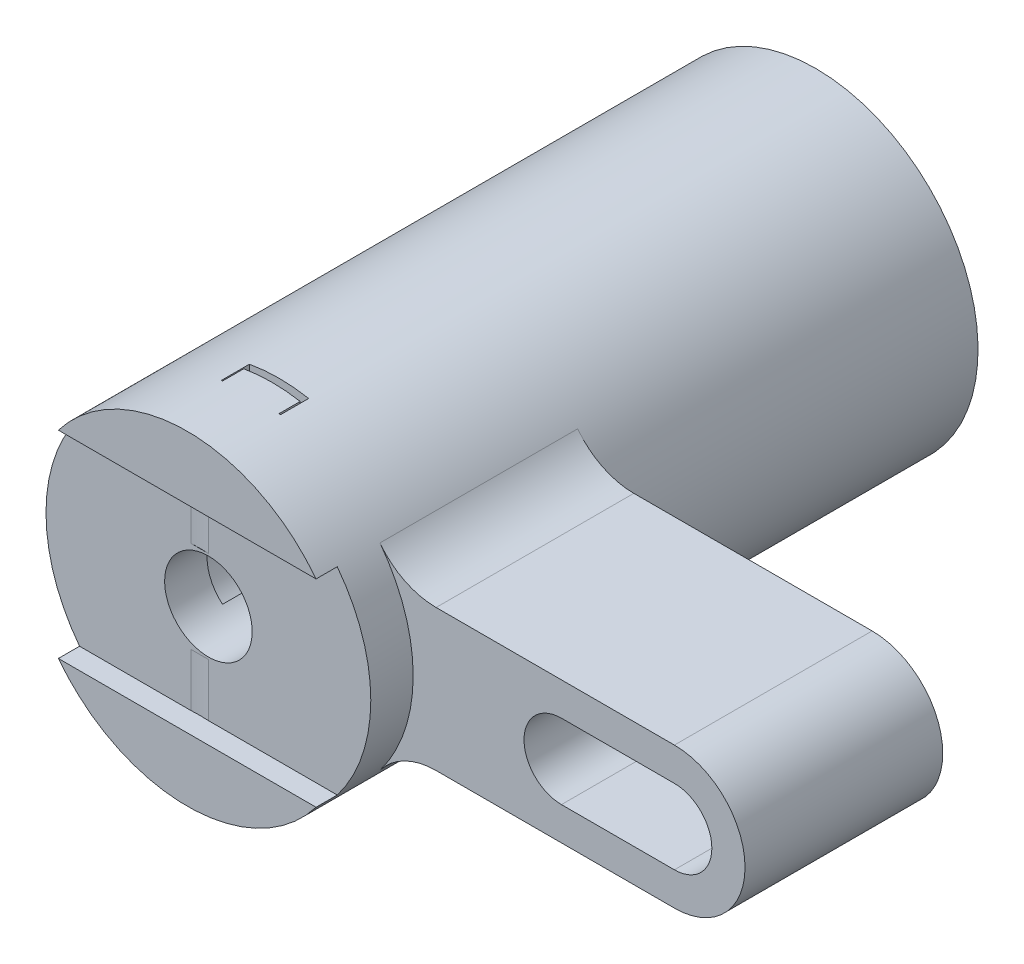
ISO-10303-21;
HEADER;
FILE_DESCRIPTION(('STEP AP214'),'2;1');
FILE_NAME('part.step','',(''),(''),'','','');
FILE_SCHEMA(('AUTOMOTIVE_DESIGN { 1 0 10303 214 1 1 1 1 }'));
ENDSEC;
DATA;
#1=APPLICATION_CONTEXT('core data for automotive mechanical design processes');
#2=APPLICATION_PROTOCOL_DEFINITION('international standard','automotive_design',2000,#1);
#3=PRODUCT_CONTEXT('',#1,'mechanical');
#4=PRODUCT('Part','Part','',(#3));
#5=PRODUCT_RELATED_PRODUCT_CATEGORY('part','',(#4));
#6=PRODUCT_DEFINITION_FORMATION('','',#4);
#7=PRODUCT_DEFINITION_CONTEXT('part definition',#1,'design');
#8=PRODUCT_DEFINITION('design','',#6,#7);
#9=PRODUCT_DEFINITION_SHAPE('','',#8);
#10=(LENGTH_UNIT() NAMED_UNIT(*) SI_UNIT(.MILLI.,.METRE.));
#11=(NAMED_UNIT(*) PLANE_ANGLE_UNIT() SI_UNIT($,.RADIAN.));
#12=(NAMED_UNIT(*) SI_UNIT($,.STERADIAN.) SOLID_ANGLE_UNIT());
#13=UNCERTAINTY_MEASURE_WITH_UNIT(LENGTH_MEASURE(1.E-05),#10,'distance_accuracy_value','');
#14=(GEOMETRIC_REPRESENTATION_CONTEXT(3) GLOBAL_UNCERTAINTY_ASSIGNED_CONTEXT((#13)) GLOBAL_UNIT_ASSIGNED_CONTEXT((#10,
#11,#12)) REPRESENTATION_CONTEXT('',''));
#15=CARTESIAN_POINT('',(0.,0.,0.));
#16=DIRECTION('',(0.,0.,1.));
#17=DIRECTION('',(1.,0.,0.));
#18=AXIS2_PLACEMENT_3D('',#15,#16,#17);
#19=CARTESIAN_POINT('',(-10.0000000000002,-3.25,103.977));
#20=DIRECTION('',(0.,-1.,0.));
#21=DIRECTION('',(-1.,0.,0.));
#22=AXIS2_PLACEMENT_3D('',#19,#20,#21);
#23=PLANE('',#22);
#24=CARTESIAN_POINT('',(0.,-3.25,62.977));
#25=CARTESIAN_POINT('',(1.17809724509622,-3.25,63.059375));
#26=CARTESIAN_POINT('',(2.38889185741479,-3.25,62.9073425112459));
#27=CARTESIAN_POINT('',(4.68855121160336,-3.25,62.133116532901));
#28=CARTESIAN_POINT('',(5.77641227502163,-3.25,61.5109889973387));
#29=CARTESIAN_POINT('',(7.65048483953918,-3.25,59.869908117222));
#30=CARTESIAN_POINT('',(8.43577630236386,-3.25,58.8514177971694));
#31=CARTESIAN_POINT('',(9.56393765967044,-3.25,56.5583078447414));
#32=CARTESIAN_POINT('',(9.906125,-3.25,55.2844915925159));
#33=CARTESIAN_POINT('',(10.070875,-3.25,52.669508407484));
#34=CARTESIAN_POINT('',(9.89311450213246,-3.25,51.329370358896));
#35=CARTESIAN_POINT('',(9.01985437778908,-3.25,48.7906214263));
#36=CARTESIAN_POINT('',(8.32445967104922,-3.25,47.5931082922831));
#37=CARTESIAN_POINT('',(6.50038754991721,-3.25,45.5360444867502));
#38=CARTESIAN_POINT('',(5.37224515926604,-3.25,44.6774858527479));
#39=CARTESIAN_POINT('',(2.84004562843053,-3.25,43.4502903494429));
#40=CARTESIAN_POINT('',(1.43688593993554,-3.25,43.082375));
#41=CARTESIAN_POINT('',(-1.43688593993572,-3.25,42.917625));
#42=CARTESIAN_POINT('',(-2.90636742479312,-3.25,43.1211135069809));
#43=CARTESIAN_POINT('',(-5.68420593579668,-3.25,44.0934077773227));
#44=CARTESIAN_POINT('',(-6.99137114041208,-3.25,44.8620696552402));
#45=CARTESIAN_POINT('',(-9.23142618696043,-3.25,46.8691330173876));
#46=CARTESIAN_POINT('',(-10.1632519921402,-3.25,48.1069274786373));
#47=CARTESIAN_POINT('',(-11.4894816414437,-3.25,50.8782165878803));
#48=CARTESIAN_POINT('',(-11.883125,-3.25,52.4107197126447));
#49=CARTESIAN_POINT('',(-12.047875,-3.25,55.5432802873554));
#50=CARTESIAN_POINT('',(-11.8186584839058,-3.25,57.1421052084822));
#51=CARTESIAN_POINT('',(-10.7473300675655,-3.25,60.1590332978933));
#52=CARTESIAN_POINT('',(-9.90540101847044,-3.25,61.5758505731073));
#53=CARTESIAN_POINT('',(-7.71534641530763,-3.25,63.998896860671));
#54=CARTESIAN_POINT('',(-6.36789988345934,-3.25,65.0039898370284));
#55=CARTESIAN_POINT('',(-3.35752119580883,-3.25,66.4292536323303));
#56=CARTESIAN_POINT('',(-1.69567463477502,-3.25,66.848625));
#57=CARTESIAN_POINT('',(0.,-3.25,66.931));
#58=B_SPLINE_CURVE_WITH_KNOTS('',3,(#24,#25,#26,#27,#28,#29,#30,#31,#32,#33,#34,#35,#36,#37,#38,
#39,#40,#41,#42,#43,#44,#45,#46,#47,#48,#49,#50,#51,#52,#53,#54,#55,#56,#57),.UNSPECIFIED.,.F.,
.F.,(4,2,2,2,2,2,2,2,2,2,2,2,2,2,2,2,4),(0.,0.0625,0.125,0.1875,0.25,0.3125,0.375,0.4375,0.5,
0.5625,0.625,0.6875,0.75,0.8125,0.875,0.9375,1.),.UNSPECIFIED.);
#59=CARTESIAN_POINT('',(-1.24892937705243,-3.25,43.));
#60=VERTEX_POINT('',#59);
#61=CARTESIAN_POINT('',(0.,-3.25,43.));
#62=VERTEX_POINT('',#61);
#63=EDGE_CURVE('E409',#60,#62,#58,.F.);
#64=ORIENTED_EDGE('',*,*,#63,.T.);
#65=DIRECTION('',(1.,0.,0.));
#66=VECTOR('',#65,1.);
#67=CARTESIAN_POINT('',(0.,-3.25,43.));
#68=LINE('',#67,#66);
#69=EDGE_CURVE('E587',#60,#62,#68,.T.);
#70=ORIENTED_EDGE('',*,*,#69,.F.);
#71=EDGE_LOOP('',(#64,#70));
#72=FACE_BOUND('',#71,.T.);
#73=ADVANCED_FACE('F14',(#72),#23,.T.);
#74=CARTESIAN_POINT('',(0.,9.5,62.977));
#75=CARTESIAN_POINT('',(1.17809724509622,9.5,63.059375));
#76=CARTESIAN_POINT('',(2.38889185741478,9.5,62.9073425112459));
#77=CARTESIAN_POINT('',(4.68855121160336,9.5,62.133116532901));
#78=CARTESIAN_POINT('',(5.77641227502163,9.5,61.5109889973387));
#79=CARTESIAN_POINT('',(7.65048483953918,9.5,59.869908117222));
#80=CARTESIAN_POINT('',(8.43577630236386,9.5,58.8514177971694));
#81=CARTESIAN_POINT('',(9.56393765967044,9.5,56.5583078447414));
#82=CARTESIAN_POINT('',(9.906125,9.5,55.284491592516));
#83=CARTESIAN_POINT('',(10.070875,9.5,52.669508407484));
#84=CARTESIAN_POINT('',(9.89311450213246,9.5,51.3293703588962));
#85=CARTESIAN_POINT('',(9.01985437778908,9.5,48.7906214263));
#86=CARTESIAN_POINT('',(8.32445967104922,9.5,47.5931082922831));
#87=CARTESIAN_POINT('',(6.50038754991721,9.5,45.5360444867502));
#88=CARTESIAN_POINT('',(5.37224515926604,9.5,44.6774858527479));
#89=CARTESIAN_POINT('',(2.84004562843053,9.5,43.4502903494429));
#90=CARTESIAN_POINT('',(1.43688593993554,9.5,43.082375));
#91=CARTESIAN_POINT('',(-1.43688593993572,9.5,42.917625));
#92=CARTESIAN_POINT('',(-2.90636742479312,9.5,43.1211135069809));
#93=CARTESIAN_POINT('',(-5.68420593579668,9.5,44.0934077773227));
#94=CARTESIAN_POINT('',(-6.99137114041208,9.5,44.8620696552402));
#95=CARTESIAN_POINT('',(-9.23142618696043,9.5,46.8691330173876));
#96=CARTESIAN_POINT('',(-10.1632519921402,9.5,48.1069274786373));
#97=CARTESIAN_POINT('',(-11.4894816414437,9.5,50.8782165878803));
#98=CARTESIAN_POINT('',(-11.883125,9.5,52.4107197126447));
#99=CARTESIAN_POINT('',(-12.047875,9.5,55.5432802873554));
#100=CARTESIAN_POINT('',(-11.8186584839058,9.5,57.1421052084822));
#101=CARTESIAN_POINT('',(-10.7473300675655,9.5,60.1590332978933));
#102=CARTESIAN_POINT('',(-9.90540101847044,9.5,61.5758505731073));
#103=CARTESIAN_POINT('',(-7.71534641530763,9.5,63.998896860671));
#104=CARTESIAN_POINT('',(-6.36789988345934,9.5,65.0039898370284));
#105=CARTESIAN_POINT('',(-3.35752119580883,9.5,66.4292536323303));
#106=CARTESIAN_POINT('',(-1.69567463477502,9.5,66.848625));
#107=CARTESIAN_POINT('',(0.,9.5,66.931));
#108=B_SPLINE_CURVE_WITH_KNOTS('',3,(#74,#75,#76,#77,#78,#79,#80,#81,#82,#83,#84,#85,#86,#87,
#88,#89,#90,#91,#92,#93,#94,#95,#96,#97,#98,#99,#100,#101,#102,#103,#104,#105,#106,#107),
.UNSPECIFIED.,.F.,.F.,(4,2,2,2,2,2,2,2,2,2,2,2,2,2,2,2,4),(0.,0.0625,0.125,0.1875,0.25,0.3125,
0.375,0.4375,0.5,0.5625,0.625,0.6875,0.75,0.8125,0.875,0.9375,1.),.UNSPECIFIED.);
#109=DIRECTION('',(0.,-1.,0.));
#110=VECTOR('',#109,1.);
#111=SURFACE_OF_LINEAR_EXTRUSION('',#108,#110);
#112=ORIENTED_EDGE('',*,*,#63,.F.);
#113=DIRECTION('',(0.,-1.,0.));
#114=VECTOR('',#113,1.);
#115=CARTESIAN_POINT('',(-1.24892937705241,-5.125,43.));
#116=LINE('',#115,#114);
#117=CARTESIAN_POINT('',(-1.24892937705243,-7.,43.));
#118=VERTEX_POINT('',#117);
#119=EDGE_CURVE('E434',#118,#60,#116,.F.);
#120=ORIENTED_EDGE('',*,*,#119,.F.);
#121=CARTESIAN_POINT('',(0.,-7.,62.977));
#122=CARTESIAN_POINT('',(1.17809724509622,-7.,63.059375));
#123=CARTESIAN_POINT('',(2.38889185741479,-7.,62.9073425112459));
#124=CARTESIAN_POINT('',(4.68855121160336,-7.,62.133116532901));
#125=CARTESIAN_POINT('',(5.77641227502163,-7.,61.5109889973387));
#126=CARTESIAN_POINT('',(7.65048483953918,-7.,59.869908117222));
#127=CARTESIAN_POINT('',(8.43577630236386,-7.,58.8514177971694));
#128=CARTESIAN_POINT('',(9.56393765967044,-7.,56.5583078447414));
#129=CARTESIAN_POINT('',(9.906125,-7.,55.2844915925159));
#130=CARTESIAN_POINT('',(10.070875,-7.,52.669508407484));
#131=CARTESIAN_POINT('',(9.89311450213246,-7.,51.329370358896));
#132=CARTESIAN_POINT('',(9.01985437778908,-7.,48.7906214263));
#133=CARTESIAN_POINT('',(8.32445967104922,-7.,47.5931082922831));
#134=CARTESIAN_POINT('',(6.50038754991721,-7.,45.5360444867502));
#135=CARTESIAN_POINT('',(5.37224515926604,-7.,44.6774858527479));
#136=CARTESIAN_POINT('',(2.84004562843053,-7.,43.4502903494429));
#137=CARTESIAN_POINT('',(1.43688593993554,-7.,43.082375));
#138=CARTESIAN_POINT('',(-1.43688593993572,-7.,42.917625));
#139=CARTESIAN_POINT('',(-2.90636742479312,-7.,43.1211135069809));
#140=CARTESIAN_POINT('',(-5.68420593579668,-7.,44.0934077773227));
#141=CARTESIAN_POINT('',(-6.99137114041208,-7.,44.8620696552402));
#142=CARTESIAN_POINT('',(-9.23142618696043,-7.,46.8691330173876));
#143=CARTESIAN_POINT('',(-10.1632519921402,-7.,48.1069274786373));
#144=CARTESIAN_POINT('',(-11.4894816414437,-7.,50.8782165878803));
#145=CARTESIAN_POINT('',(-11.883125,-7.,52.4107197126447));
#146=CARTESIAN_POINT('',(-12.047875,-7.,55.5432802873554));
#147=CARTESIAN_POINT('',(-11.8186584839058,-7.,57.1421052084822));
#148=CARTESIAN_POINT('',(-10.7473300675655,-7.,60.1590332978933));
#149=CARTESIAN_POINT('',(-9.90540101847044,-7.,61.5758505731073));
#150=CARTESIAN_POINT('',(-7.71534641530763,-7.,63.998896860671));
#151=CARTESIAN_POINT('',(-6.36789988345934,-7.,65.0039898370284));
#152=CARTESIAN_POINT('',(-3.35752119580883,-7.,66.4292536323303));
#153=CARTESIAN_POINT('',(-1.69567463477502,-7.,66.848625));
#154=CARTESIAN_POINT('',(0.,-7.,66.931));
#155=B_SPLINE_CURVE_WITH_KNOTS('',3,(#121,#122,#123,#124,#125,#126,#127,#128,#129,#130,#131,
#132,#133,#134,#135,#136,#137,#138,#139,#140,#141,#142,#143,#144,#145,#146,#147,#148,#149,#150,
#151,#152,#153,#154),.UNSPECIFIED.,.F.,.F.,(4,2,2,2,2,2,2,2,2,2,2,2,2,2,2,2,4),(0.,0.0625,0.125,
0.1875,0.25,0.3125,0.375,0.4375,0.5,0.5625,0.625,0.6875,0.75,0.8125,0.875,0.9375,1.),.UNSPECIFIED.);
#156=CARTESIAN_POINT('',(0.,-7.,43.));
#157=VERTEX_POINT('',#156);
#158=EDGE_CURVE('E127',#118,#157,#155,.F.);
#159=ORIENTED_EDGE('',*,*,#158,.T.);
#160=DIRECTION('',(0.,-1.,0.));
#161=VECTOR('',#160,1.);
#162=CARTESIAN_POINT('',(-1.59984872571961E-12,-5.125,43.));
#163=LINE('',#162,#161);
#164=EDGE_CURVE('E592',#62,#157,#163,.T.);
#165=ORIENTED_EDGE('',*,*,#164,.F.);
#166=EDGE_LOOP('',(#112,#120,#159,#165));
#167=FACE_BOUND('',#166,.T.);
#168=ADVANCED_FACE('F447',(#167),#111,.T.);
#169=CARTESIAN_POINT('',(-10.0000000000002,3.25,103.977));
#170=DIRECTION('',(0.,1.,0.));
#171=DIRECTION('',(1.,0.,0.));
#172=AXIS2_PLACEMENT_3D('',#169,#170,#171);
#173=PLANE('',#172);
#174=CARTESIAN_POINT('',(0.,3.25,62.977));
#175=CARTESIAN_POINT('',(1.17809724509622,3.25,63.059375));
#176=CARTESIAN_POINT('',(2.38889185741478,3.25,62.9073425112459));
#177=CARTESIAN_POINT('',(4.68855121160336,3.25,62.133116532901));
#178=CARTESIAN_POINT('',(5.77641227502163,3.25,61.5109889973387));
#179=CARTESIAN_POINT('',(7.65048483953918,3.25,59.869908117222));
#180=CARTESIAN_POINT('',(8.43577630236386,3.25,58.8514177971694));
#181=CARTESIAN_POINT('',(9.56393765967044,3.25,56.5583078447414));
#182=CARTESIAN_POINT('',(9.906125,3.25,55.284491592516));
#183=CARTESIAN_POINT('',(10.070875,3.25,52.669508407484));
#184=CARTESIAN_POINT('',(9.89311450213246,3.25,51.329370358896));
#185=CARTESIAN_POINT('',(9.01985437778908,3.25,48.7906214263));
#186=CARTESIAN_POINT('',(8.32445967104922,3.25,47.5931082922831));
#187=CARTESIAN_POINT('',(6.50038754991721,3.25,45.5360444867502));
#188=CARTESIAN_POINT('',(5.37224515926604,3.25,44.6774858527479));
#189=CARTESIAN_POINT('',(2.84004562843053,3.25,43.4502903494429));
#190=CARTESIAN_POINT('',(1.43688593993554,3.25,43.082375));
#191=CARTESIAN_POINT('',(-1.43688593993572,3.25,42.917625));
#192=CARTESIAN_POINT('',(-2.90636742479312,3.25,43.1211135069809));
#193=CARTESIAN_POINT('',(-5.68420593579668,3.25,44.0934077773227));
#194=CARTESIAN_POINT('',(-6.99137114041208,3.25,44.8620696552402));
#195=CARTESIAN_POINT('',(-9.23142618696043,3.25,46.8691330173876));
#196=CARTESIAN_POINT('',(-10.1632519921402,3.25,48.1069274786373));
#197=CARTESIAN_POINT('',(-11.4894816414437,3.25,50.8782165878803));
#198=CARTESIAN_POINT('',(-11.883125,3.25,52.4107197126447));
#199=CARTESIAN_POINT('',(-12.047875,3.25,55.5432802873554));
#200=CARTESIAN_POINT('',(-11.8186584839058,3.25,57.1421052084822));
#201=CARTESIAN_POINT('',(-10.7473300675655,3.25,60.1590332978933));
#202=CARTESIAN_POINT('',(-9.90540101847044,3.25,61.5758505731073));
#203=CARTESIAN_POINT('',(-7.71534641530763,3.25,63.998896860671));
#204=CARTESIAN_POINT('',(-6.36789988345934,3.25,65.0039898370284));
#205=CARTESIAN_POINT('',(-3.35752119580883,3.25,66.4292536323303));
#206=CARTESIAN_POINT('',(-1.69567463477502,3.25,66.848625));
#207=CARTESIAN_POINT('',(0.,3.25,66.931));
#208=B_SPLINE_CURVE_WITH_KNOTS('',3,(#174,#175,#176,#177,#178,#179,#180,#181,#182,#183,#184,
#185,#186,#187,#188,#189,#190,#191,#192,#193,#194,#195,#196,#197,#198,#199,#200,#201,#202,#203,
#204,#205,#206,#207),.UNSPECIFIED.,.F.,.F.,(4,2,2,2,2,2,2,2,2,2,2,2,2,2,2,2,4),(0.,0.0625,0.125,
0.1875,0.25,0.3125,0.375,0.4375,0.5,0.5625,0.625,0.6875,0.75,0.8125,0.875,0.9375,1.),.UNSPECIFIED.);
#209=CARTESIAN_POINT('',(0.,3.25,43.));
#210=VERTEX_POINT('',#209);
#211=CARTESIAN_POINT('',(-1.24892937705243,3.25,43.));
#212=VERTEX_POINT('',#211);
#213=EDGE_CURVE('E426',#210,#212,#208,.T.);
#214=ORIENTED_EDGE('',*,*,#213,.T.);
#215=DIRECTION('',(-1.,0.,0.));
#216=VECTOR('',#215,1.);
#217=CARTESIAN_POINT('',(0.,3.25,43.));
#218=LINE('',#217,#216);
#219=EDGE_CURVE('E297',#210,#212,#218,.T.);
#220=ORIENTED_EDGE('',*,*,#219,.F.);
#221=EDGE_LOOP('',(#214,#220));
#222=FACE_BOUND('',#221,.T.);
#223=ADVANCED_FACE('F451',(#222),#173,.T.);
#224=CARTESIAN_POINT('',(0.,7.,62.977));
#225=CARTESIAN_POINT('',(1.17809724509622,7.,63.059375));
#226=CARTESIAN_POINT('',(2.38889185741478,7.,62.9073425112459));
#227=CARTESIAN_POINT('',(4.68855121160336,7.,62.133116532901));
#228=CARTESIAN_POINT('',(5.77641227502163,7.,61.5109889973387));
#229=CARTESIAN_POINT('',(7.65048483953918,7.,59.869908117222));
#230=CARTESIAN_POINT('',(8.43577630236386,7.,58.8514177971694));
#231=CARTESIAN_POINT('',(9.56393765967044,7.,56.5583078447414));
#232=CARTESIAN_POINT('',(9.906125,7.,55.284491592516));
#233=CARTESIAN_POINT('',(10.070875,7.,52.669508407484));
#234=CARTESIAN_POINT('',(9.89311450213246,7.,51.3293703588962));
#235=CARTESIAN_POINT('',(9.01985437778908,7.,48.7906214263));
#236=CARTESIAN_POINT('',(8.32445967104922,7.,47.5931082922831));
#237=CARTESIAN_POINT('',(6.50038754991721,7.,45.5360444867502));
#238=CARTESIAN_POINT('',(5.37224515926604,7.,44.6774858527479));
#239=CARTESIAN_POINT('',(2.84004562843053,7.,43.4502903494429));
#240=CARTESIAN_POINT('',(1.43688593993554,7.,43.082375));
#241=CARTESIAN_POINT('',(-1.43688593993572,7.,42.917625));
#242=CARTESIAN_POINT('',(-2.90636742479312,7.,43.1211135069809));
#243=CARTESIAN_POINT('',(-5.68420593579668,7.,44.0934077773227));
#244=CARTESIAN_POINT('',(-6.99137114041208,7.,44.8620696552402));
#245=CARTESIAN_POINT('',(-9.23142618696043,7.,46.8691330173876));
#246=CARTESIAN_POINT('',(-10.1632519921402,7.,48.1069274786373));
#247=CARTESIAN_POINT('',(-11.4894816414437,7.,50.8782165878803));
#248=CARTESIAN_POINT('',(-11.883125,7.,52.4107197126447));
#249=CARTESIAN_POINT('',(-12.047875,7.,55.5432802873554));
#250=CARTESIAN_POINT('',(-11.8186584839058,7.,57.1421052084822));
#251=CARTESIAN_POINT('',(-10.7473300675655,7.,60.1590332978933));
#252=CARTESIAN_POINT('',(-9.90540101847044,7.,61.5758505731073));
#253=CARTESIAN_POINT('',(-7.71534641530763,7.,63.998896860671));
#254=CARTESIAN_POINT('',(-6.36789988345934,7.,65.0039898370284));
#255=CARTESIAN_POINT('',(-3.35752119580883,7.,66.4292536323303));
#256=CARTESIAN_POINT('',(-1.69567463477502,7.,66.848625));
#257=CARTESIAN_POINT('',(0.,7.,66.931));
#258=B_SPLINE_CURVE_WITH_KNOTS('',3,(#224,#225,#226,#227,#228,#229,#230,#231,#232,#233,#234,
#235,#236,#237,#238,#239,#240,#241,#242,#243,#244,#245,#246,#247,#248,#249,#250,#251,#252,#253,
#254,#255,#256,#257),.UNSPECIFIED.,.F.,.F.,(4,2,2,2,2,2,2,2,2,2,2,2,2,2,2,2,4),(0.,0.0625,0.125,
0.1875,0.25,0.3125,0.375,0.4375,0.5,0.5625,0.625,0.6875,0.75,0.8125,0.875,0.9375,1.),.UNSPECIFIED.);
#259=CARTESIAN_POINT('',(-1.24892937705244,7.,43.));
#260=VERTEX_POINT('',#259);
#261=CARTESIAN_POINT('',(0.,7.,43.));
#262=VERTEX_POINT('',#261);
#263=EDGE_CURVE('E407',#260,#262,#258,.F.);
#264=ORIENTED_EDGE('',*,*,#263,.F.);
#265=DIRECTION('',(0.,-1.,0.));
#266=VECTOR('',#265,1.);
#267=CARTESIAN_POINT('',(-1.24892937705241,5.125,43.));
#268=LINE('',#267,#266);
#269=EDGE_CURVE('E712',#212,#260,#268,.F.);
#270=ORIENTED_EDGE('',*,*,#269,.F.);
#271=ORIENTED_EDGE('',*,*,#213,.F.);
#272=DIRECTION('',(0.,-1.,0.));
#273=VECTOR('',#272,1.);
#274=CARTESIAN_POINT('',(-1.61025706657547E-12,5.125,43.));
#275=LINE('',#274,#273);
#276=EDGE_CURVE('E709',#262,#210,#275,.T.);
#277=ORIENTED_EDGE('',*,*,#276,.F.);
#278=EDGE_LOOP('',(#264,#270,#271,#277));
#279=FACE_BOUND('',#278,.T.);
#280=ADVANCED_FACE('F452',(#279),#111,.T.);
#281=CARTESIAN_POINT('',(-2.,11.3247516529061,38.5));
#282=DIRECTION('',(1.,0.,0.));
#283=DIRECTION('',(0.,1.,0.));
#284=AXIS2_PLACEMENT_3D('',#281,#282,#283);
#285=PLANE('',#284);
#286=DIRECTION('',(0.,1.,0.));
#287=VECTOR('',#286,1.);
#288=CARTESIAN_POINT('',(-2.,11.3247516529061,38.5));
#289=LINE('',#288,#287);
#290=CARTESIAN_POINT('',(-2.,2.36854385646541,38.5));
#291=VERTEX_POINT('',#290);
#292=CARTESIAN_POINT('',(-2.,11.3247516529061,38.5));
#293=VERTEX_POINT('',#292);
#294=EDGE_CURVE('E734',#291,#293,#289,.T.);
#295=ORIENTED_EDGE('',*,*,#294,.F.);
#296=DIRECTION('',(0.,0.,1.));
#297=VECTOR('',#296,1.);
#298=CARTESIAN_POINT('',(-2.,2.36854385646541,43.));
#299=LINE('',#298,#297);
#300=CARTESIAN_POINT('',(-2.,2.36854385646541,40.));
#301=VERTEX_POINT('',#300);
#302=EDGE_CURVE('E699',#291,#301,#299,.T.);
#303=ORIENTED_EDGE('',*,*,#302,.T.);
#304=DIRECTION('',(0.,1.,0.));
#305=VECTOR('',#304,1.);
#306=CARTESIAN_POINT('',(-2.,11.3247516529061,40.));
#307=LINE('',#306,#305);
#308=CARTESIAN_POINT('',(-2.,11.3247516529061,40.));
#309=VERTEX_POINT('',#308);
#310=EDGE_CURVE('E651',#301,#309,#307,.T.);
#311=ORIENTED_EDGE('',*,*,#310,.T.);
#312=DIRECTION('',(0.,0.,1.));
#313=VECTOR('',#312,1.);
#314=CARTESIAN_POINT('',(-2.,11.3247516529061,38.5));
#315=LINE('',#314,#313);
#316=EDGE_CURVE('E265',#293,#309,#315,.T.);
#317=ORIENTED_EDGE('',*,*,#316,.F.);
#318=EDGE_LOOP('',(#295,#303,#311,#317));
#319=FACE_BOUND('',#318,.T.);
#320=ADVANCED_FACE('F469',(#319),#285,.F.);
#321=CARTESIAN_POINT('',(0.,0.,38.5));
#322=DIRECTION('',(0.,0.,-1.));
#323=DIRECTION('',(0.,-1.,0.));
#324=AXIS2_PLACEMENT_3D('',#321,#322,#323);
#325=PLANE('',#324);
#326=CARTESIAN_POINT('',(0.,0.,38.5));
#327=DIRECTION('',(0.,0.,-1.));
#328=DIRECTION('',(0.,-1.,0.));
#329=AXIS2_PLACEMENT_3D('',#326,#327,#328);
#330=CIRCLE('',#329,3.1);
#331=CARTESIAN_POINT('',(2.,2.36854385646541,38.5));
#332=VERTEX_POINT('',#331);
#333=EDGE_CURVE('E595',#291,#332,#330,.T.);
#334=ORIENTED_EDGE('',*,*,#333,.F.);
#335=ORIENTED_EDGE('',*,*,#294,.T.);
#336=CARTESIAN_POINT('',(0.,0.,38.5));
#337=DIRECTION('',(0.,0.,-1.));
#338=DIRECTION('',(0.,-1.,0.));
#339=AXIS2_PLACEMENT_3D('',#336,#337,#338);
#340=CIRCLE('',#339,11.5);
#341=CARTESIAN_POINT('',(2.,11.3247516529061,38.5));
#342=VERTEX_POINT('',#341);
#343=EDGE_CURVE('E659',#293,#342,#340,.T.);
#344=ORIENTED_EDGE('',*,*,#343,.T.);
#345=DIRECTION('',(0.,-1.,0.));
#346=VECTOR('',#345,1.);
#347=CARTESIAN_POINT('',(2.,11.3247516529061,38.5));
#348=LINE('',#347,#346);
#349=EDGE_CURVE('E740',#342,#332,#348,.T.);
#350=ORIENTED_EDGE('',*,*,#349,.T.);
#351=EDGE_LOOP('',(#334,#335,#344,#350));
#352=FACE_BOUND('',#351,.T.);
#353=ADVANCED_FACE('F464',(#352),#325,.T.);
#354=CARTESIAN_POINT('',(2.,-2.3685438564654,38.5));
#355=VERTEX_POINT('',#354);
#356=CARTESIAN_POINT('',(-2.,-2.3685438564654,38.5));
#357=VERTEX_POINT('',#356);
#358=EDGE_CURVE('E598',#355,#357,#330,.T.);
#359=ORIENTED_EDGE('',*,*,#358,.F.);
#360=CARTESIAN_POINT('',(2.,-11.3247516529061,38.5));
#361=VERTEX_POINT('',#360);
#362=EDGE_CURVE('E752',#355,#361,#348,.T.);
#363=ORIENTED_EDGE('',*,*,#362,.T.);
#364=CARTESIAN_POINT('',(0.,0.,38.5));
#365=DIRECTION('',(0.,0.,-1.));
#366=DIRECTION('',(0.,-1.,0.));
#367=AXIS2_PLACEMENT_3D('',#364,#365,#366);
#368=CIRCLE('',#367,11.5);
#369=CARTESIAN_POINT('',(-2.,-11.3247516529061,38.5));
#370=VERTEX_POINT('',#369);
#371=EDGE_CURVE('E737',#361,#370,#368,.T.);
#372=ORIENTED_EDGE('',*,*,#371,.T.);
#373=EDGE_CURVE('E670',#370,#357,#289,.T.);
#374=ORIENTED_EDGE('',*,*,#373,.T.);
#375=EDGE_LOOP('',(#359,#363,#372,#374));
#376=FACE_BOUND('',#375,.T.);
#377=ADVANCED_FACE('F460',(#376),#325,.T.);
#378=CARTESIAN_POINT('',(-2.,-11.3247516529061,40.));
#379=VERTEX_POINT('',#378);
#380=CARTESIAN_POINT('',(-2.,-2.3685438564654,40.));
#381=VERTEX_POINT('',#380);
#382=EDGE_CURVE('E653',#379,#381,#307,.T.);
#383=ORIENTED_EDGE('',*,*,#382,.T.);
#384=DIRECTION('',(0.,0.,1.));
#385=VECTOR('',#384,1.);
#386=CARTESIAN_POINT('',(-2.,-2.3685438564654,43.));
#387=LINE('',#386,#385);
#388=EDGE_CURVE('E704',#381,#357,#387,.F.);
#389=ORIENTED_EDGE('',*,*,#388,.T.);
#390=ORIENTED_EDGE('',*,*,#373,.F.);
#391=DIRECTION('',(0.,0.,1.));
#392=VECTOR('',#391,1.);
#393=CARTESIAN_POINT('',(-2.,-11.3247516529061,38.5));
#394=LINE('',#393,#392);
#395=EDGE_CURVE('E669',#370,#379,#394,.T.);
#396=ORIENTED_EDGE('',*,*,#395,.T.);
#397=EDGE_LOOP('',(#383,#389,#390,#396));
#398=FACE_BOUND('',#397,.T.);
#399=ADVANCED_FACE('F463',(#398),#285,.F.);
#400=CARTESIAN_POINT('',(0.,0.,40.));
#401=DIRECTION('',(0.,0.,-1.));
#402=DIRECTION('',(0.,-1.,0.));
#403=AXIS2_PLACEMENT_3D('',#400,#401,#402);
#404=PLANE('',#403);
#405=CARTESIAN_POINT('',(0.,0.,40.));
#406=DIRECTION('',(0.,0.,-1.));
#407=DIRECTION('',(-1.,0.,0.));
#408=AXIS2_PLACEMENT_3D('',#405,#406,#407);
#409=CIRCLE('',#408,3.3);
#410=CARTESIAN_POINT('',(-2.1,2.54558441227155,40.));
#411=VERTEX_POINT('',#410);
#412=CARTESIAN_POINT('',(-2.1,-2.54558441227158,40.));
#413=VERTEX_POINT('',#412);
#414=EDGE_CURVE('E24',#411,#413,#409,.F.);
#415=ORIENTED_EDGE('',*,*,#414,.F.);
#416=DIRECTION('',(0.,1.,0.));
#417=VECTOR('',#416,1.);
#418=CARTESIAN_POINT('',(-2.1,0.,40.));
#419=LINE('',#418,#417);
#420=CARTESIAN_POINT('',(-2.1,11.306635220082,40.));
#421=VERTEX_POINT('',#420);
#422=EDGE_CURVE('E9',#411,#421,#419,.T.);
#423=ORIENTED_EDGE('',*,*,#422,.T.);
#424=CARTESIAN_POINT('',(0.,0.,40.));
#425=DIRECTION('',(0.,0.,-1.));
#426=DIRECTION('',(0.,-1.,0.));
#427=AXIS2_PLACEMENT_3D('',#424,#425,#426);
#428=CIRCLE('',#427,11.5);
#429=EDGE_CURVE('E244',#421,#309,#428,.T.);
#430=ORIENTED_EDGE('',*,*,#429,.T.);
#431=ORIENTED_EDGE('',*,*,#310,.F.);
#432=CARTESIAN_POINT('',(0.,0.,40.));
#433=DIRECTION('',(0.,0.,-1.));
#434=DIRECTION('',(0.,-1.,0.));
#435=AXIS2_PLACEMENT_3D('',#432,#433,#434);
#436=CIRCLE('',#435,3.1);
#437=EDGE_CURVE('E702',#381,#301,#436,.T.);
#438=ORIENTED_EDGE('',*,*,#437,.F.);
#439=ORIENTED_EDGE('',*,*,#382,.F.);
#440=CARTESIAN_POINT('',(-2.1,-11.3066352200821,40.));
#441=VERTEX_POINT('',#440);
#442=EDGE_CURVE('E266',#379,#441,#428,.T.);
#443=ORIENTED_EDGE('',*,*,#442,.T.);
#444=DIRECTION('',(0.,1.,0.));
#445=VECTOR('',#444,1.);
#446=CARTESIAN_POINT('',(-2.1,0.,40.));
#447=LINE('',#446,#445);
#448=EDGE_CURVE('E280',#441,#413,#447,.T.);
#449=ORIENTED_EDGE('',*,*,#448,.T.);
#450=EDGE_LOOP('',(#415,#423,#430,#431,#438,#439,#443,#449));
#451=FACE_BOUND('',#450,.T.);
#452=ADVANCED_FACE('F241',(#451),#404,.T.);
#453=CARTESIAN_POINT('',(0.,0.,44.5));
#454=DIRECTION('',(0.,0.,-1.));
#455=DIRECTION('',(0.,-1.,0.));
#456=AXIS2_PLACEMENT_3D('',#453,#454,#455);
#457=PLANE('',#456);
#458=CARTESIAN_POINT('',(0.,0.,44.5));
#459=DIRECTION('',(0.,0.,1.));
#460=DIRECTION('',(0.,-1.,0.));
#461=AXIS2_PLACEMENT_3D('',#458,#459,#460);
#462=CIRCLE('',#461,11.5);
#463=CARTESIAN_POINT('',(9.12414379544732,7.,44.5));
#464=VERTEX_POINT('',#463);
#465=CARTESIAN_POINT('',(-9.12414379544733,7.,44.5));
#466=VERTEX_POINT('',#465);
#467=EDGE_CURVE('E613',#464,#466,#462,.T.);
#468=ORIENTED_EDGE('',*,*,#467,.T.);
#469=DIRECTION('',(1.,0.,0.));
#470=VECTOR('',#469,1.);
#471=CARTESIAN_POINT('',(9.12414379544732,7.,44.5));
#472=LINE('',#471,#470);
#473=EDGE_CURVE('E625',#466,#464,#472,.T.);
#474=ORIENTED_EDGE('',*,*,#473,.T.);
#475=EDGE_LOOP('',(#468,#474));
#476=FACE_BOUND('',#475,.T.);
#477=ADVANCED_FACE('F483',(#476),#457,.F.);
#478=CARTESIAN_POINT('',(9.12414379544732,7.,44.5));
#479=DIRECTION('',(0.,1.,0.));
#480=DIRECTION('',(-1.,0.,0.));
#481=AXIS2_PLACEMENT_3D('',#478,#479,#480);
#482=PLANE('',#481);
#483=DIRECTION('',(0.,0.,-1.));
#484=VECTOR('',#483,1.);
#485=CARTESIAN_POINT('',(9.12414379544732,7.,44.5));
#486=LINE('',#485,#484);
#487=CARTESIAN_POINT('',(9.12414379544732,7.,43.));
#488=VERTEX_POINT('',#487);
#489=EDGE_CURVE('E622',#464,#488,#486,.T.);
#490=ORIENTED_EDGE('',*,*,#489,.F.);
#491=ORIENTED_EDGE('',*,*,#473,.F.);
#492=DIRECTION('',(0.,0.,-1.));
#493=VECTOR('',#492,1.);
#494=CARTESIAN_POINT('',(-9.12414379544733,7.,44.5));
#495=LINE('',#494,#493);
#496=CARTESIAN_POINT('',(-9.12414379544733,7.,43.));
#497=VERTEX_POINT('',#496);
#498=EDGE_CURVE('E294',#466,#497,#495,.T.);
#499=ORIENTED_EDGE('',*,*,#498,.T.);
#500=DIRECTION('',(1.,0.,0.));
#501=VECTOR('',#500,1.);
#502=CARTESIAN_POINT('',(9.12414379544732,7.,43.));
#503=LINE('',#502,#501);
#504=EDGE_CURVE('E604',#497,#260,#503,.T.);
#505=ORIENTED_EDGE('',*,*,#504,.T.);
#506=ORIENTED_EDGE('',*,*,#263,.T.);
#507=EDGE_CURVE('E601',#262,#488,#503,.T.);
#508=ORIENTED_EDGE('',*,*,#507,.T.);
#509=EDGE_LOOP('',(#490,#491,#499,#505,#506,#508));
#510=FACE_BOUND('',#509,.T.);
#511=ADVANCED_FACE('F478',(#510),#482,.F.);
#512=CARTESIAN_POINT('',(0.,0.,44.5));
#513=DIRECTION('',(0.,0.,1.));
#514=DIRECTION('',(0.,1.,0.));
#515=AXIS2_PLACEMENT_3D('',#512,#513,#514);
#516=PLANE('',#515);
#517=CARTESIAN_POINT('',(0.,0.,44.5));
#518=DIRECTION('',(0.,0.,1.));
#519=DIRECTION('',(0.,1.,0.));
#520=AXIS2_PLACEMENT_3D('',#517,#518,#519);
#521=CIRCLE('',#520,11.5);
#522=CARTESIAN_POINT('',(-9.12414379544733,-7.,44.5));
#523=VERTEX_POINT('',#522);
#524=CARTESIAN_POINT('',(9.12414379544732,-7.,44.5));
#525=VERTEX_POINT('',#524);
#526=EDGE_CURVE('E745',#523,#525,#521,.T.);
#527=ORIENTED_EDGE('',*,*,#526,.T.);
#528=DIRECTION('',(-1.,0.,0.));
#529=VECTOR('',#528,1.);
#530=CARTESIAN_POINT('',(9.12414379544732,-7.,44.5));
#531=LINE('',#530,#529);
#532=EDGE_CURVE('E748',#525,#523,#531,.T.);
#533=ORIENTED_EDGE('',*,*,#532,.T.);
#534=EDGE_LOOP('',(#527,#533));
#535=FACE_BOUND('',#534,.T.);
#536=ADVANCED_FACE('F474',(#535),#516,.T.);
#537=CARTESIAN_POINT('',(9.12414379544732,-7.,44.5));
#538=DIRECTION('',(0.,-1.,0.));
#539=DIRECTION('',(1.,0.,0.));
#540=AXIS2_PLACEMENT_3D('',#537,#538,#539);
#541=PLANE('',#540);
#542=DIRECTION('',(0.,0.,-1.));
#543=VECTOR('',#542,1.);
#544=CARTESIAN_POINT('',(-9.12414379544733,-7.,44.5));
#545=LINE('',#544,#543);
#546=CARTESIAN_POINT('',(-9.12414379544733,-7.,43.));
#547=VERTEX_POINT('',#546);
#548=EDGE_CURVE('E749',#523,#547,#545,.T.);
#549=ORIENTED_EDGE('',*,*,#548,.F.);
#550=ORIENTED_EDGE('',*,*,#532,.F.);
#551=DIRECTION('',(0.,0.,-1.));
#552=VECTOR('',#551,1.);
#553=CARTESIAN_POINT('',(9.12414379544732,-7.,44.5));
#554=LINE('',#553,#552);
#555=CARTESIAN_POINT('',(9.12414379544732,-7.,43.));
#556=VERTEX_POINT('',#555);
#557=EDGE_CURVE('E605',#525,#556,#554,.T.);
#558=ORIENTED_EDGE('',*,*,#557,.T.);
#559=DIRECTION('',(-1.,0.,0.));
#560=VECTOR('',#559,1.);
#561=CARTESIAN_POINT('',(9.12414379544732,-7.,43.));
#562=LINE('',#561,#560);
#563=EDGE_CURVE('E743',#556,#157,#562,.T.);
#564=ORIENTED_EDGE('',*,*,#563,.T.);
#565=ORIENTED_EDGE('',*,*,#158,.F.);
#566=EDGE_CURVE('E683',#118,#547,#562,.T.);
#567=ORIENTED_EDGE('',*,*,#566,.T.);
#568=EDGE_LOOP('',(#549,#550,#558,#564,#565,#567));
#569=FACE_BOUND('',#568,.T.);
#570=ADVANCED_FACE('F477',(#569),#541,.F.);
#571=CARTESIAN_POINT('',(0.,0.,43.));
#572=DIRECTION('',(0.,0.,1.));
#573=DIRECTION('',(0.,1.,0.));
#574=AXIS2_PLACEMENT_3D('',#571,#572,#573);
#575=PLANE('',#574);
#576=CARTESIAN_POINT('',(0.,0.,43.));
#577=DIRECTION('',(0.,0.,1.));
#578=DIRECTION('',(0.,1.,0.));
#579=AXIS2_PLACEMENT_3D('',#576,#577,#578);
#580=CIRCLE('',#579,3.1);
#581=CARTESIAN_POINT('',(0.,3.1,43.));
#582=VERTEX_POINT('',#581);
#583=EDGE_CURVE('E706',#582,#582,#580,.T.);
#584=ORIENTED_EDGE('',*,*,#583,.F.);
#585=EDGE_LOOP('',(#584));
#586=FACE_BOUND('',#585,.T.);
#587=ORIENTED_EDGE('',*,*,#507,.F.);
#588=ORIENTED_EDGE('',*,*,#276,.T.);
#589=ORIENTED_EDGE('',*,*,#219,.T.);
#590=ORIENTED_EDGE('',*,*,#269,.T.);
#591=ORIENTED_EDGE('',*,*,#504,.F.);
#592=CARTESIAN_POINT('',(0.,0.,43.));
#593=DIRECTION('',(0.,0.,-1.));
#594=DIRECTION('',(0.,-1.,0.));
#595=AXIS2_PLACEMENT_3D('',#592,#593,#594);
#596=CIRCLE('',#595,11.5);
#597=EDGE_CURVE('E270',#547,#497,#596,.T.);
#598=ORIENTED_EDGE('',*,*,#597,.F.);
#599=ORIENTED_EDGE('',*,*,#566,.F.);
#600=ORIENTED_EDGE('',*,*,#119,.T.);
#601=ORIENTED_EDGE('',*,*,#69,.T.);
#602=ORIENTED_EDGE('',*,*,#164,.T.);
#603=ORIENTED_EDGE('',*,*,#563,.F.);
#604=EDGE_CURVE('E620',#488,#556,#596,.T.);
#605=ORIENTED_EDGE('',*,*,#604,.F.);
#606=EDGE_LOOP('',(#587,#588,#589,#590,#591,#598,#599,#600,#601,#602,#603,#605));
#607=FACE_BOUND('',#606,.T.);
#608=ADVANCED_FACE('F472',(#586,#607),#575,.T.);
#609=CARTESIAN_POINT('',(2.,11.3247516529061,38.5));
#610=DIRECTION('',(-1.,0.,0.));
#611=DIRECTION('',(0.,-1.,0.));
#612=AXIS2_PLACEMENT_3D('',#609,#610,#611);
#613=PLANE('',#612);
#614=DIRECTION('',(0.,-1.,0.));
#615=VECTOR('',#614,1.);
#616=CARTESIAN_POINT('',(2.,11.3247516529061,40.));
#617=LINE('',#616,#615);
#618=CARTESIAN_POINT('',(2.,11.3247516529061,40.));
#619=VERTEX_POINT('',#618);
#620=CARTESIAN_POINT('',(2.,2.36854385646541,40.));
#621=VERTEX_POINT('',#620);
#622=EDGE_CURVE('E654',#619,#621,#617,.T.);
#623=ORIENTED_EDGE('',*,*,#622,.T.);
#624=DIRECTION('',(0.,0.,1.));
#625=VECTOR('',#624,1.);
#626=CARTESIAN_POINT('',(2.,2.36854385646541,43.));
#627=LINE('',#626,#625);
#628=EDGE_CURVE('E695',#621,#332,#627,.F.);
#629=ORIENTED_EDGE('',*,*,#628,.T.);
#630=ORIENTED_EDGE('',*,*,#349,.F.);
#631=DIRECTION('',(0.,0.,1.));
#632=VECTOR('',#631,1.);
#633=CARTESIAN_POINT('',(2.,11.3247516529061,38.5));
#634=LINE('',#633,#632);
#635=EDGE_CURVE('E677',#342,#619,#634,.T.);
#636=ORIENTED_EDGE('',*,*,#635,.T.);
#637=EDGE_LOOP('',(#623,#629,#630,#636));
#638=FACE_BOUND('',#637,.T.);
#639=ADVANCED_FACE('F458',(#638),#613,.F.);
#640=CARTESIAN_POINT('',(0.,0.,43.));
#641=DIRECTION('',(0.,0.,1.));
#642=DIRECTION('',(0.,1.,0.));
#643=AXIS2_PLACEMENT_3D('',#640,#641,#642);
#644=CYLINDRICAL_SURFACE('',#643,3.1);
#645=ORIENTED_EDGE('',*,*,#583,.T.);
#646=EDGE_LOOP('',(#645));
#647=FACE_BOUND('',#646,.T.);
#648=ORIENTED_EDGE('',*,*,#358,.T.);
#649=ORIENTED_EDGE('',*,*,#388,.F.);
#650=ORIENTED_EDGE('',*,*,#437,.T.);
#651=ORIENTED_EDGE('',*,*,#302,.F.);
#652=ORIENTED_EDGE('',*,*,#333,.T.);
#653=ORIENTED_EDGE('',*,*,#628,.F.);
#654=CARTESIAN_POINT('',(0.,0.,40.));
#655=DIRECTION('',(0.,0.,-1.));
#656=DIRECTION('',(0.,-1.,0.));
#657=AXIS2_PLACEMENT_3D('',#654,#655,#656);
#658=CIRCLE('',#657,3.1);
#659=CARTESIAN_POINT('',(2.,-2.3685438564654,40.));
#660=VERTEX_POINT('',#659);
#661=EDGE_CURVE('E693',#621,#660,#658,.T.);
#662=ORIENTED_EDGE('',*,*,#661,.T.);
#663=DIRECTION('',(0.,0.,1.));
#664=VECTOR('',#663,1.);
#665=CARTESIAN_POINT('',(2.,-2.3685438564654,43.));
#666=LINE('',#665,#664);
#667=EDGE_CURVE('E689',#355,#660,#666,.T.);
#668=ORIENTED_EDGE('',*,*,#667,.F.);
#669=EDGE_LOOP('',(#648,#649,#650,#651,#652,#653,#662,#668));
#670=FACE_BOUND('',#669,.T.);
#671=ADVANCED_FACE('F454',(#647,#670),#644,.F.);
#672=ORIENTED_EDGE('',*,*,#362,.F.);
#673=ORIENTED_EDGE('',*,*,#667,.T.);
#674=CARTESIAN_POINT('',(2.,-11.3247516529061,40.));
#675=VERTEX_POINT('',#674);
#676=EDGE_CURVE('E606',#660,#675,#617,.T.);
#677=ORIENTED_EDGE('',*,*,#676,.T.);
#678=DIRECTION('',(0.,0.,1.));
#679=VECTOR('',#678,1.);
#680=CARTESIAN_POINT('',(2.,-11.3247516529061,38.5));
#681=LINE('',#680,#679);
#682=EDGE_CURVE('E673',#361,#675,#681,.T.);
#683=ORIENTED_EDGE('',*,*,#682,.F.);
#684=EDGE_LOOP('',(#672,#673,#677,#683));
#685=FACE_BOUND('',#684,.T.);
#686=ADVANCED_FACE('F457',(#685),#613,.F.);
#687=CARTESIAN_POINT('',(0.,0.,40.));
#688=DIRECTION('',(0.,0.,-1.));
#689=DIRECTION('',(0.,-1.,0.));
#690=AXIS2_PLACEMENT_3D('',#687,#688,#689);
#691=CYLINDRICAL_SURFACE('',#690,11.5);
#692=CARTESIAN_POINT('',(2.1,-11.3066352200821,40.));
#693=VERTEX_POINT('',#692);
#694=EDGE_CURVE('E292',#693,#675,#428,.T.);
#695=ORIENTED_EDGE('',*,*,#694,.F.);
#696=DIRECTION('',(0.,0.,-1.));
#697=VECTOR('',#696,1.);
#698=CARTESIAN_POINT('',(2.1,-11.3066352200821,40.));
#699=LINE('',#698,#697);
#700=CARTESIAN_POINT('',(2.1,-11.3066352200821,38.));
#701=VERTEX_POINT('',#700);
#702=EDGE_CURVE('E386',#693,#701,#699,.T.);
#703=ORIENTED_EDGE('',*,*,#702,.T.);
#704=CARTESIAN_POINT('',(0.,0.,38.));
#705=DIRECTION('',(0.,0.,1.));
#706=DIRECTION('',(0.,1.,0.));
#707=AXIS2_PLACEMENT_3D('',#704,#705,#706);
#708=CIRCLE('',#707,11.5);
#709=CARTESIAN_POINT('',(-2.1,-11.3066352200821,38.));
#710=VERTEX_POINT('',#709);
#711=EDGE_CURVE('E762',#710,#701,#708,.T.);
#712=ORIENTED_EDGE('',*,*,#711,.F.);
#713=DIRECTION('',(0.,0.,-1.));
#714=VECTOR('',#713,1.);
#715=CARTESIAN_POINT('',(-2.1,-11.3066352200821,40.));
#716=LINE('',#715,#714);
#717=EDGE_CURVE('E764',#710,#441,#716,.F.);
#718=ORIENTED_EDGE('',*,*,#717,.T.);
#719=ORIENTED_EDGE('',*,*,#442,.F.);
#720=ORIENTED_EDGE('',*,*,#395,.F.);
#721=ORIENTED_EDGE('',*,*,#371,.F.);
#722=ORIENTED_EDGE('',*,*,#682,.T.);
#723=EDGE_LOOP('',(#695,#703,#712,#718,#719,#720,#721,#722));
#724=FACE_BOUND('',#723,.T.);
#725=CARTESIAN_POINT('',(9.14731240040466,6.96969696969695,40.));
#726=VERTEX_POINT('',#725);
#727=CARTESIAN_POINT('',(9.14731240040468,-6.96969696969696,40.));
#728=VERTEX_POINT('',#727);
#729=EDGE_CURVE('E273',#726,#728,#428,.T.);
#730=ORIENTED_EDGE('',*,*,#729,.F.);
#731=DIRECTION('',(0.,0.,-1.));
#732=VECTOR('',#731,1.);
#733=CARTESIAN_POINT('',(9.14731240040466,6.96969696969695,40.));
#734=LINE('',#733,#732);
#735=CARTESIAN_POINT('',(9.14731240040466,6.96969696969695,26.));
#736=VERTEX_POINT('',#735);
#737=EDGE_CURVE('E391',#726,#736,#734,.T.);
#738=ORIENTED_EDGE('',*,*,#737,.T.);
#739=CARTESIAN_POINT('',(0.,0.,26.));
#740=DIRECTION('',(0.,0.,1.));
#741=DIRECTION('',(0.,1.,0.));
#742=AXIS2_PLACEMENT_3D('',#739,#740,#741);
#743=CIRCLE('',#742,11.5);
#744=CARTESIAN_POINT('',(9.14731240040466,-6.96969696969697,26.));
#745=VERTEX_POINT('',#744);
#746=EDGE_CURVE('E364',#745,#736,#743,.T.);
#747=ORIENTED_EDGE('',*,*,#746,.F.);
#748=DIRECTION('',(0.,0.,-1.));
#749=VECTOR('',#748,1.);
#750=CARTESIAN_POINT('',(9.14731240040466,-6.96969696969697,40.));
#751=LINE('',#750,#749);
#752=EDGE_CURVE('E394',#745,#728,#751,.F.);
#753=ORIENTED_EDGE('',*,*,#752,.T.);
#754=EDGE_LOOP('',(#730,#738,#747,#753));
#755=FACE_BOUND('',#754,.T.);
#756=ORIENTED_EDGE('',*,*,#604,.T.);
#757=ORIENTED_EDGE('',*,*,#557,.F.);
#758=ORIENTED_EDGE('',*,*,#526,.F.);
#759=ORIENTED_EDGE('',*,*,#548,.T.);
#760=ORIENTED_EDGE('',*,*,#597,.T.);
#761=ORIENTED_EDGE('',*,*,#498,.F.);
#762=ORIENTED_EDGE('',*,*,#467,.F.);
#763=ORIENTED_EDGE('',*,*,#489,.T.);
#764=EDGE_LOOP('',(#756,#757,#758,#759,#760,#761,#762,#763));
#765=FACE_BOUND('',#764,.T.);
#766=DIRECTION('',(0.,0.,-1.));
#767=VECTOR('',#766,1.);
#768=CARTESIAN_POINT('',(2.1,11.306635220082,40.));
#769=LINE('',#768,#767);
#770=CARTESIAN_POINT('',(2.1,11.306635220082,38.));
#771=VERTEX_POINT('',#770);
#772=CARTESIAN_POINT('',(2.1,11.306635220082,40.));
#773=VERTEX_POINT('',#772);
#774=EDGE_CURVE('E256',#771,#773,#769,.F.);
#775=ORIENTED_EDGE('',*,*,#774,.T.);
#776=EDGE_CURVE('E267',#619,#773,#428,.T.);
#777=ORIENTED_EDGE('',*,*,#776,.F.);
#778=ORIENTED_EDGE('',*,*,#635,.F.);
#779=ORIENTED_EDGE('',*,*,#343,.F.);
#780=ORIENTED_EDGE('',*,*,#316,.T.);
#781=ORIENTED_EDGE('',*,*,#429,.F.);
#782=DIRECTION('',(0.,0.,-1.));
#783=VECTOR('',#782,1.);
#784=CARTESIAN_POINT('',(-2.1,11.306635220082,40.));
#785=LINE('',#784,#783);
#786=CARTESIAN_POINT('',(-2.1,11.306635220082,38.));
#787=VERTEX_POINT('',#786);
#788=EDGE_CURVE('E250',#421,#787,#785,.T.);
#789=ORIENTED_EDGE('',*,*,#788,.T.);
#790=EDGE_CURVE('E257',#771,#787,#708,.T.);
#791=ORIENTED_EDGE('',*,*,#790,.F.);
#792=EDGE_LOOP('',(#775,#777,#778,#779,#780,#781,#789,#791));
#793=FACE_BOUND('',#792,.T.);
#794=CARTESIAN_POINT('',(0.,0.,0.));
#795=DIRECTION('',(0.,0.,1.));
#796=DIRECTION('',(0.,1.,0.));
#797=AXIS2_PLACEMENT_3D('',#794,#795,#796);
#798=CIRCLE('',#797,11.5);
#799=CARTESIAN_POINT('',(0.,11.5,0.));
#800=VERTEX_POINT('',#799);
#801=EDGE_CURVE('E365',#800,#800,#798,.T.);
#802=ORIENTED_EDGE('',*,*,#801,.T.);
#803=EDGE_LOOP('',(#802));
#804=FACE_BOUND('',#803,.T.);
#805=ADVANCED_FACE('F261',(#724,#755,#765,#793,#804),#691,.T.);
#806=ORIENTED_EDGE('',*,*,#776,.T.);
#807=DIRECTION('',(0.,-1.,0.));
#808=VECTOR('',#807,1.);
#809=CARTESIAN_POINT('',(2.1,0.,40.));
#810=LINE('',#809,#808);
#811=CARTESIAN_POINT('',(2.1,2.54558441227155,40.));
#812=VERTEX_POINT('',#811);
#813=EDGE_CURVE('E278',#773,#812,#810,.T.);
#814=ORIENTED_EDGE('',*,*,#813,.T.);
#815=CARTESIAN_POINT('',(0.,0.,40.));
#816=DIRECTION('',(0.,0.,-1.));
#817=DIRECTION('',(-1.,0.,0.));
#818=AXIS2_PLACEMENT_3D('',#815,#816,#817);
#819=CIRCLE('',#818,3.3);
#820=CARTESIAN_POINT('',(2.1,-2.54558441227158,40.));
#821=VERTEX_POINT('',#820);
#822=EDGE_CURVE('E296',#821,#812,#819,.F.);
#823=ORIENTED_EDGE('',*,*,#822,.F.);
#824=DIRECTION('',(0.,-1.,0.));
#825=VECTOR('',#824,1.);
#826=CARTESIAN_POINT('',(2.1,0.,40.));
#827=LINE('',#826,#825);
#828=EDGE_CURVE('E295',#821,#693,#827,.T.);
#829=ORIENTED_EDGE('',*,*,#828,.T.);
#830=ORIENTED_EDGE('',*,*,#694,.T.);
#831=ORIENTED_EDGE('',*,*,#676,.F.);
#832=ORIENTED_EDGE('',*,*,#661,.F.);
#833=ORIENTED_EDGE('',*,*,#622,.F.);
#834=EDGE_LOOP('',(#806,#814,#823,#829,#830,#831,#832,#833));
#835=FACE_BOUND('',#834,.T.);
#836=ADVANCED_FACE('F492',(#835),#404,.T.);
#837=CARTESIAN_POINT('',(-8.,0.,24.));
#838=DIRECTION('',(0.,0.,1.));
#839=DIRECTION('',(0.,1.,0.));
#840=AXIS2_PLACEMENT_3D('',#837,#838,#839);
#841=PLANE('',#840);
#842=CARTESIAN_POINT('',(0.,0.,24.));
#843=DIRECTION('',(0.,0.,1.));
#844=DIRECTION('',(0.,1.,0.));
#845=AXIS2_PLACEMENT_3D('',#842,#843,#844);
#846=CIRCLE('',#845,3.);
#847=CARTESIAN_POINT('',(0.,3.,24.));
#848=VERTEX_POINT('',#847);
#849=EDGE_CURVE('E307',#848,#848,#846,.T.);
#850=ORIENTED_EDGE('',*,*,#849,.T.);
#851=EDGE_LOOP('',(#850));
#852=FACE_BOUND('',#851,.T.);
#853=CARTESIAN_POINT('',(0.,0.,24.));
#854=DIRECTION('',(0.,0.,-1.));
#855=DIRECTION('',(0.,-1.,0.));
#856=AXIS2_PLACEMENT_3D('',#853,#854,#855);
#857=CIRCLE('',#856,8.);
#858=CARTESIAN_POINT('',(0.,-8.,24.));
#859=VERTEX_POINT('',#858);
#860=EDGE_CURVE('E313',#859,#859,#857,.T.);
#861=ORIENTED_EDGE('',*,*,#860,.T.);
#862=EDGE_LOOP('',(#861));
#863=FACE_BOUND('',#862,.T.);
#864=ADVANCED_FACE('F503',(#852,#863),#841,.F.);
#865=CARTESIAN_POINT('',(0.,0.,44.5));
#866=DIRECTION('',(0.,0.,-1.));
#867=DIRECTION('',(-0.5,0.866025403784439,0.));
#868=AXIS2_PLACEMENT_3D('',#865,#866,#867);
#869=CYLINDRICAL_SURFACE('',#868,3.);
#870=ORIENTED_EDGE('',*,*,#849,.F.);
#871=EDGE_LOOP('',(#870));
#872=FACE_BOUND('',#871,.T.);
#873=CARTESIAN_POINT('',(0.,0.,26.));
#874=DIRECTION('',(0.,0.,-1.));
#875=DIRECTION('',(0.,-1.,0.));
#876=AXIS2_PLACEMENT_3D('',#873,#874,#875);
#877=CIRCLE('',#876,3.);
#878=CARTESIAN_POINT('',(0.,-3.,26.));
#879=VERTEX_POINT('',#878);
#880=EDGE_CURVE('E310',#879,#879,#877,.T.);
#881=ORIENTED_EDGE('',*,*,#880,.F.);
#882=EDGE_LOOP('',(#881));
#883=FACE_BOUND('',#882,.T.);
#884=ADVANCED_FACE('F499',(#872,#883),#869,.F.);
#885=CARTESIAN_POINT('',(0.,0.,-14.));
#886=DIRECTION('',(0.,0.,-1.));
#887=DIRECTION('',(0.,-1.,0.));
#888=AXIS2_PLACEMENT_3D('',#885,#886,#887);
#889=CYLINDRICAL_SURFACE('',#888,8.);
#890=ORIENTED_EDGE('',*,*,#860,.F.);
#891=EDGE_LOOP('',(#890));
#892=FACE_BOUND('',#891,.T.);
#893=CARTESIAN_POINT('',(0.,0.,0.));
#894=DIRECTION('',(0.,0.,1.));
#895=DIRECTION('',(0.,1.,0.));
#896=AXIS2_PLACEMENT_3D('',#893,#894,#895);
#897=CIRCLE('',#896,8.);
#898=CARTESIAN_POINT('',(0.,8.,0.));
#899=VERTEX_POINT('',#898);
#900=EDGE_CURVE('E18',#899,#899,#897,.T.);
#901=ORIENTED_EDGE('',*,*,#900,.F.);
#902=EDGE_LOOP('',(#901));
#903=FACE_BOUND('',#902,.T.);
#904=ADVANCED_FACE('F502',(#892,#903),#889,.F.);
#905=CARTESIAN_POINT('',(30.,2.65,-0.001000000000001));
#906=DIRECTION('',(0.,1.,0.));
#907=DIRECTION('',(-1.,0.,0.));
#908=AXIS2_PLACEMENT_3D('',#905,#906,#907);
#909=PLANE('',#908);
#910=DIRECTION('',(1.,0.,0.));
#911=VECTOR('',#910,1.);
#912=CARTESIAN_POINT('',(30.,2.65,26.));
#913=LINE('',#912,#911);
#914=CARTESIAN_POINT('',(22.,2.65,26.));
#915=VERTEX_POINT('',#914);
#916=CARTESIAN_POINT('',(30.,2.65,26.));
#917=VERTEX_POINT('',#916);
#918=EDGE_CURVE('E355',#915,#917,#913,.T.);
#919=ORIENTED_EDGE('',*,*,#918,.T.);
#920=DIRECTION('',(0.,0.,1.));
#921=VECTOR('',#920,1.);
#922=CARTESIAN_POINT('',(30.,2.65,-0.001000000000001));
#923=LINE('',#922,#921);
#924=CARTESIAN_POINT('',(30.,2.65,40.));
#925=VERTEX_POINT('',#924);
#926=EDGE_CURVE('E352',#917,#925,#923,.T.);
#927=ORIENTED_EDGE('',*,*,#926,.T.);
#928=DIRECTION('',(-1.,0.,0.));
#929=VECTOR('',#928,1.);
#930=CARTESIAN_POINT('',(30.,2.65,40.));
#931=LINE('',#930,#929);
#932=CARTESIAN_POINT('',(22.,2.65,40.));
#933=VERTEX_POINT('',#932);
#934=EDGE_CURVE('E343',#925,#933,#931,.T.);
#935=ORIENTED_EDGE('',*,*,#934,.T.);
#936=DIRECTION('',(0.,0.,1.));
#937=VECTOR('',#936,1.);
#938=CARTESIAN_POINT('',(22.,2.65,-0.001000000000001));
#939=LINE('',#938,#937);
#940=EDGE_CURVE('E358',#915,#933,#939,.T.);
#941=ORIENTED_EDGE('',*,*,#940,.F.);
#942=EDGE_LOOP('',(#919,#927,#935,#941));
#943=FACE_BOUND('',#942,.T.);
#944=ADVANCED_FACE('F507',(#943),#909,.F.);
#945=CARTESIAN_POINT('',(22.,0.,-0.001000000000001));
#946=DIRECTION('',(0.,0.,1.));
#947=DIRECTION('',(0.,1.,0.));
#948=AXIS2_PLACEMENT_3D('',#945,#946,#947);
#949=CYLINDRICAL_SURFACE('',#948,2.65);
#950=CARTESIAN_POINT('',(22.,0.,26.));
#951=DIRECTION('',(0.,0.,1.));
#952=DIRECTION('',(0.,1.,0.));
#953=AXIS2_PLACEMENT_3D('',#950,#951,#952);
#954=CIRCLE('',#953,2.65);
#955=CARTESIAN_POINT('',(22.,-2.65,26.));
#956=VERTEX_POINT('',#955);
#957=EDGE_CURVE('E333',#956,#915,#954,.F.);
#958=ORIENTED_EDGE('',*,*,#957,.T.);
#959=ORIENTED_EDGE('',*,*,#940,.T.);
#960=CARTESIAN_POINT('',(22.,0.,40.));
#961=DIRECTION('',(0.,0.,1.));
#962=DIRECTION('',(0.,1.,0.));
#963=AXIS2_PLACEMENT_3D('',#960,#961,#962);
#964=CIRCLE('',#963,2.65);
#965=CARTESIAN_POINT('',(22.,-2.65,40.));
#966=VERTEX_POINT('',#965);
#967=EDGE_CURVE('E346',#933,#966,#964,.T.);
#968=ORIENTED_EDGE('',*,*,#967,.T.);
#969=DIRECTION('',(0.,0.,1.));
#970=VECTOR('',#969,1.);
#971=CARTESIAN_POINT('',(22.,-2.65,-0.001000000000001));
#972=LINE('',#971,#970);
#973=EDGE_CURVE('E356',#956,#966,#972,.T.);
#974=ORIENTED_EDGE('',*,*,#973,.F.);
#975=EDGE_LOOP('',(#958,#959,#968,#974));
#976=FACE_BOUND('',#975,.T.);
#977=ADVANCED_FACE('F540',(#976),#949,.F.);
#978=CARTESIAN_POINT('',(30.,-2.65,-0.001000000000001));
#979=DIRECTION('',(0.,-1.,0.));
#980=DIRECTION('',(1.,0.,0.));
#981=AXIS2_PLACEMENT_3D('',#978,#979,#980);
#982=PLANE('',#981);
#983=DIRECTION('',(-1.,0.,0.));
#984=VECTOR('',#983,1.);
#985=CARTESIAN_POINT('',(30.,-2.65,26.));
#986=LINE('',#985,#984);
#987=CARTESIAN_POINT('',(30.,-2.65,26.));
#988=VERTEX_POINT('',#987);
#989=EDGE_CURVE('E335',#988,#956,#986,.T.);
#990=ORIENTED_EDGE('',*,*,#989,.T.);
#991=ORIENTED_EDGE('',*,*,#973,.T.);
#992=DIRECTION('',(1.,0.,0.));
#993=VECTOR('',#992,1.);
#994=CARTESIAN_POINT('',(30.,-2.65,40.));
#995=LINE('',#994,#993);
#996=CARTESIAN_POINT('',(30.,-2.65,40.));
#997=VERTEX_POINT('',#996);
#998=EDGE_CURVE('E349',#966,#997,#995,.T.);
#999=ORIENTED_EDGE('',*,*,#998,.T.);
#1000=DIRECTION('',(0.,0.,1.));
#1001=VECTOR('',#1000,1.);
#1002=CARTESIAN_POINT('',(30.,-2.65,-0.001000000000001));
#1003=LINE('',#1002,#1001);
#1004=EDGE_CURVE('E353',#988,#997,#1003,.T.);
#1005=ORIENTED_EDGE('',*,*,#1004,.F.);
#1006=EDGE_LOOP('',(#990,#991,#999,#1005));
#1007=FACE_BOUND('',#1006,.T.);
#1008=ADVANCED_FACE('F536',(#1007),#982,.F.);
#1009=CARTESIAN_POINT('',(30.,0.,-0.001000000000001));
#1010=DIRECTION('',(0.,0.,1.));
#1011=DIRECTION('',(0.,1.,0.));
#1012=AXIS2_PLACEMENT_3D('',#1009,#1010,#1011);
#1013=CYLINDRICAL_SURFACE('',#1012,2.65);
#1014=CARTESIAN_POINT('',(30.,0.,26.));
#1015=DIRECTION('',(0.,0.,1.));
#1016=DIRECTION('',(0.,1.,0.));
#1017=AXIS2_PLACEMENT_3D('',#1014,#1015,#1016);
#1018=CIRCLE('',#1017,2.65);
#1019=EDGE_CURVE('E338',#917,#988,#1018,.F.);
#1020=ORIENTED_EDGE('',*,*,#1019,.T.);
#1021=ORIENTED_EDGE('',*,*,#1004,.T.);
#1022=CARTESIAN_POINT('',(30.,0.,40.));
#1023=DIRECTION('',(0.,0.,1.));
#1024=DIRECTION('',(0.,1.,0.));
#1025=AXIS2_PLACEMENT_3D('',#1022,#1023,#1024);
#1026=CIRCLE('',#1025,2.65);
#1027=EDGE_CURVE('E341',#997,#925,#1026,.T.);
#1028=ORIENTED_EDGE('',*,*,#1027,.T.);
#1029=ORIENTED_EDGE('',*,*,#926,.F.);
#1030=EDGE_LOOP('',(#1020,#1021,#1028,#1029));
#1031=FACE_BOUND('',#1030,.T.);
#1032=ADVANCED_FACE('F539',(#1031),#1013,.F.);
#1033=CARTESIAN_POINT('',(30.,5.,40.));
#1034=DIRECTION('',(0.,-1.,0.));
#1035=DIRECTION('',(1.,0.,0.));
#1036=AXIS2_PLACEMENT_3D('',#1033,#1034,#1035);
#1037=PLANE('',#1036);
#1038=DIRECTION('',(-1.,0.,0.));
#1039=VECTOR('',#1038,1.);
#1040=CARTESIAN_POINT('',(30.,5.,26.));
#1041=LINE('',#1040,#1039);
#1042=CARTESIAN_POINT('',(30.,5.,26.));
#1043=VERTEX_POINT('',#1042);
#1044=CARTESIAN_POINT('',(13.1244047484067,5.,26.));
#1045=VERTEX_POINT('',#1044);
#1046=EDGE_CURVE('E379',#1043,#1045,#1041,.T.);
#1047=ORIENTED_EDGE('',*,*,#1046,.T.);
#1048=DIRECTION('',(0.,0.,1.));
#1049=VECTOR('',#1048,1.);
#1050=CARTESIAN_POINT('',(13.1244047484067,5.,40.));
#1051=LINE('',#1050,#1049);
#1052=CARTESIAN_POINT('',(13.1244047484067,5.,40.));
#1053=VERTEX_POINT('',#1052);
#1054=EDGE_CURVE('E118',#1045,#1053,#1051,.T.);
#1055=ORIENTED_EDGE('',*,*,#1054,.T.);
#1056=DIRECTION('',(-1.,0.,0.));
#1057=VECTOR('',#1056,1.);
#1058=CARTESIAN_POINT('',(30.,5.,40.));
#1059=LINE('',#1058,#1057);
#1060=CARTESIAN_POINT('',(30.,5.,40.));
#1061=VERTEX_POINT('',#1060);
#1062=EDGE_CURVE('E783',#1061,#1053,#1059,.T.);
#1063=ORIENTED_EDGE('',*,*,#1062,.F.);
#1064=DIRECTION('',(0.,0.,-1.));
#1065=VECTOR('',#1064,1.);
#1066=CARTESIAN_POINT('',(30.,5.,40.));
#1067=LINE('',#1066,#1065);
#1068=EDGE_CURVE('E771',#1061,#1043,#1067,.T.);
#1069=ORIENTED_EDGE('',*,*,#1068,.T.);
#1070=EDGE_LOOP('',(#1047,#1055,#1063,#1069));
#1071=FACE_BOUND('',#1070,.T.);
#1072=ADVANCED_FACE('F550',(#1071),#1037,.F.);
#1073=CARTESIAN_POINT('',(30.,0.,40.));
#1074=DIRECTION('',(0.,0.,-1.));
#1075=DIRECTION('',(0.,-1.,0.));
#1076=AXIS2_PLACEMENT_3D('',#1073,#1074,#1075);
#1077=CYLINDRICAL_SURFACE('',#1076,5.);
#1078=CARTESIAN_POINT('',(30.,0.,26.));
#1079=DIRECTION('',(0.,0.,1.));
#1080=DIRECTION('',(0.,1.,0.));
#1081=AXIS2_PLACEMENT_3D('',#1078,#1079,#1080);
#1082=CIRCLE('',#1081,5.);
#1083=CARTESIAN_POINT('',(30.,-5.,26.));
#1084=VERTEX_POINT('',#1083);
#1085=EDGE_CURVE('E368',#1084,#1043,#1082,.T.);
#1086=ORIENTED_EDGE('',*,*,#1085,.T.);
#1087=ORIENTED_EDGE('',*,*,#1068,.F.);
#1088=CARTESIAN_POINT('',(30.,0.,40.));
#1089=DIRECTION('',(0.,0.,1.));
#1090=DIRECTION('',(0.,1.,0.));
#1091=AXIS2_PLACEMENT_3D('',#1088,#1089,#1090);
#1092=CIRCLE('',#1091,5.);
#1093=CARTESIAN_POINT('',(30.,-5.,40.));
#1094=VERTEX_POINT('',#1093);
#1095=EDGE_CURVE('E385',#1094,#1061,#1092,.T.);
#1096=ORIENTED_EDGE('',*,*,#1095,.F.);
#1097=DIRECTION('',(0.,0.,-1.));
#1098=VECTOR('',#1097,1.);
#1099=CARTESIAN_POINT('',(30.,-5.,40.));
#1100=LINE('',#1099,#1098);
#1101=EDGE_CURVE('E775',#1094,#1084,#1100,.T.);
#1102=ORIENTED_EDGE('',*,*,#1101,.T.);
#1103=EDGE_LOOP('',(#1086,#1087,#1096,#1102));
#1104=FACE_BOUND('',#1103,.T.);
#1105=ADVANCED_FACE('F562',(#1104),#1077,.T.);
#1106=CARTESIAN_POINT('',(30.,-5.,40.));
#1107=DIRECTION('',(0.,1.,0.));
#1108=DIRECTION('',(-1.,0.,0.));
#1109=AXIS2_PLACEMENT_3D('',#1106,#1107,#1108);
#1110=PLANE('',#1109);
#1111=DIRECTION('',(1.,0.,0.));
#1112=VECTOR('',#1111,1.);
#1113=CARTESIAN_POINT('',(30.,-5.,40.));
#1114=LINE('',#1113,#1112);
#1115=CARTESIAN_POINT('',(13.1244047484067,-5.,40.));
#1116=VERTEX_POINT('',#1115);
#1117=EDGE_CURVE('E779',#1116,#1094,#1114,.T.);
#1118=ORIENTED_EDGE('',*,*,#1117,.F.);
#1119=DIRECTION('',(0.,0.,1.));
#1120=VECTOR('',#1119,1.);
#1121=CARTESIAN_POINT('',(13.1244047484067,-5.,26.));
#1122=LINE('',#1121,#1120);
#1123=CARTESIAN_POINT('',(13.1244047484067,-5.,26.));
#1124=VERTEX_POINT('',#1123);
#1125=EDGE_CURVE('E388',#1116,#1124,#1122,.F.);
#1126=ORIENTED_EDGE('',*,*,#1125,.T.);
#1127=DIRECTION('',(1.,0.,0.));
#1128=VECTOR('',#1127,1.);
#1129=CARTESIAN_POINT('',(30.,-5.,26.));
#1130=LINE('',#1129,#1128);
#1131=EDGE_CURVE('E382',#1124,#1084,#1130,.T.);
#1132=ORIENTED_EDGE('',*,*,#1131,.T.);
#1133=ORIENTED_EDGE('',*,*,#1101,.F.);
#1134=EDGE_LOOP('',(#1118,#1126,#1132,#1133));
#1135=FACE_BOUND('',#1134,.T.);
#1136=ADVANCED_FACE('F555',(#1135),#1110,.F.);
#1137=CARTESIAN_POINT('',(0.,0.,26.));
#1138=DIRECTION('',(0.,0.,-1.));
#1139=DIRECTION('',(0.,-1.,0.));
#1140=AXIS2_PLACEMENT_3D('',#1137,#1138,#1139);
#1141=PLANE('',#1140);
#1142=ORIENTED_EDGE('',*,*,#880,.T.);
#1143=EDGE_LOOP('',(#1142));
#1144=FACE_BOUND('',#1143,.T.);
#1145=CARTESIAN_POINT('',(0.,0.,26.));
#1146=DIRECTION('',(0.,0.,1.));
#1147=DIRECTION('',(0.,1.,0.));
#1148=AXIS2_PLACEMENT_3D('',#1145,#1146,#1147);
#1149=CIRCLE('',#1148,3.3);
#1150=CARTESIAN_POINT('',(0.,3.3,26.));
#1151=VERTEX_POINT('',#1150);
#1152=EDGE_CURVE('E375',#1151,#1151,#1149,.T.);
#1153=ORIENTED_EDGE('',*,*,#1152,.T.);
#1154=EDGE_LOOP('',(#1153));
#1155=FACE_BOUND('',#1154,.T.);
#1156=ADVANCED_FACE('F552',(#1144,#1155),#1141,.F.);
#1157=CARTESIAN_POINT('',(0.,0.,0.));
#1158=DIRECTION('',(0.,0.,1.));
#1159=DIRECTION('',(0.,1.,0.));
#1160=AXIS2_PLACEMENT_3D('',#1157,#1158,#1159);
#1161=PLANE('',#1160);
#1162=ORIENTED_EDGE('',*,*,#900,.T.);
#1163=EDGE_LOOP('',(#1162));
#1164=FACE_BOUND('',#1163,.T.);
#1165=ORIENTED_EDGE('',*,*,#801,.F.);
#1166=EDGE_LOOP('',(#1165));
#1167=FACE_BOUND('',#1166,.T.);
#1168=ADVANCED_FACE('F515',(#1164,#1167),#1161,.F.);
#1169=CARTESIAN_POINT('',(13.1244047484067,10.,40.));
#1170=DIRECTION('',(0.,0.,-1.));
#1171=DIRECTION('',(0.,-1.,0.));
#1172=AXIS2_PLACEMENT_3D('',#1169,#1170,#1171);
#1173=CYLINDRICAL_SURFACE('',#1172,5.);
#1174=CARTESIAN_POINT('',(13.1244047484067,10.,40.));
#1175=DIRECTION('',(0.,0.,1.));
#1176=DIRECTION('',(0.,1.,0.));
#1177=AXIS2_PLACEMENT_3D('',#1174,#1175,#1176);
#1178=CIRCLE('',#1177,5.);
#1179=EDGE_CURVE('E403',#1053,#726,#1178,.F.);
#1180=ORIENTED_EDGE('',*,*,#1179,.F.);
#1181=ORIENTED_EDGE('',*,*,#1054,.F.);
#1182=CARTESIAN_POINT('',(13.1244047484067,10.,26.));
#1183=DIRECTION('',(0.,0.,1.));
#1184=DIRECTION('',(0.,1.,0.));
#1185=AXIS2_PLACEMENT_3D('',#1182,#1183,#1184);
#1186=CIRCLE('',#1185,5.);
#1187=EDGE_CURVE('E112',#736,#1045,#1186,.T.);
#1188=ORIENTED_EDGE('',*,*,#1187,.F.);
#1189=ORIENTED_EDGE('',*,*,#737,.F.);
#1190=EDGE_LOOP('',(#1180,#1181,#1188,#1189));
#1191=FACE_BOUND('',#1190,.T.);
#1192=ADVANCED_FACE('F509',(#1191),#1173,.F.);
#1193=CARTESIAN_POINT('',(-2.1,-12.,38.));
#1194=DIRECTION('',(-1.,0.,0.));
#1195=DIRECTION('',(0.,-1.,0.));
#1196=AXIS2_PLACEMENT_3D('',#1193,#1194,#1195);
#1197=PLANE('',#1196);
#1198=DIRECTION('',(0.,0.,-1.));
#1199=VECTOR('',#1198,1.);
#1200=CARTESIAN_POINT('',(-2.1,2.54558441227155,40.));
#1201=LINE('',#1200,#1199);
#1202=CARTESIAN_POINT('',(-2.1,2.54558441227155,38.));
#1203=VERTEX_POINT('',#1202);
#1204=EDGE_CURVE('E327',#411,#1203,#1201,.T.);
#1205=ORIENTED_EDGE('',*,*,#1204,.T.);
#1206=DIRECTION('',(0.,-1.,0.));
#1207=VECTOR('',#1206,1.);
#1208=CARTESIAN_POINT('',(-2.1,-12.,38.));
#1209=LINE('',#1208,#1207);
#1210=EDGE_CURVE('E253',#787,#1203,#1209,.T.);
#1211=ORIENTED_EDGE('',*,*,#1210,.F.);
#1212=ORIENTED_EDGE('',*,*,#788,.F.);
#1213=ORIENTED_EDGE('',*,*,#422,.F.);
#1214=EDGE_LOOP('',(#1205,#1211,#1212,#1213));
#1215=FACE_BOUND('',#1214,.T.);
#1216=ADVANCED_FACE('F251',(#1215),#1197,.F.);
#1217=DIRECTION('',(0.,0.,-1.));
#1218=VECTOR('',#1217,1.);
#1219=CARTESIAN_POINT('',(-2.1,-2.54558441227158,40.));
#1220=LINE('',#1219,#1218);
#1221=CARTESIAN_POINT('',(-2.1,-2.54558441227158,38.));
#1222=VERTEX_POINT('',#1221);
#1223=EDGE_CURVE('E325',#1222,#413,#1220,.F.);
#1224=ORIENTED_EDGE('',*,*,#1223,.T.);
#1225=ORIENTED_EDGE('',*,*,#448,.F.);
#1226=ORIENTED_EDGE('',*,*,#717,.F.);
#1227=EDGE_CURVE('E319',#1222,#710,#1209,.T.);
#1228=ORIENTED_EDGE('',*,*,#1227,.F.);
#1229=EDGE_LOOP('',(#1224,#1225,#1226,#1228));
#1230=FACE_BOUND('',#1229,.T.);
#1231=ADVANCED_FACE('F521',(#1230),#1197,.F.);
#1232=CARTESIAN_POINT('',(13.1244047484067,-10.,40.));
#1233=DIRECTION('',(0.,0.,-1.));
#1234=DIRECTION('',(0.,-1.,0.));
#1235=AXIS2_PLACEMENT_3D('',#1232,#1233,#1234);
#1236=CYLINDRICAL_SURFACE('',#1235,5.);
#1237=CARTESIAN_POINT('',(13.1244047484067,-10.,40.));
#1238=DIRECTION('',(0.,0.,1.));
#1239=DIRECTION('',(0.,1.,0.));
#1240=AXIS2_PLACEMENT_3D('',#1237,#1238,#1239);
#1241=CIRCLE('',#1240,5.);
#1242=EDGE_CURVE('E401',#728,#1116,#1241,.F.);
#1243=ORIENTED_EDGE('',*,*,#1242,.F.);
#1244=ORIENTED_EDGE('',*,*,#752,.F.);
#1245=CARTESIAN_POINT('',(13.1244047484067,-10.,26.));
#1246=DIRECTION('',(0.,0.,1.));
#1247=DIRECTION('',(0.,1.,0.));
#1248=AXIS2_PLACEMENT_3D('',#1245,#1246,#1247);
#1249=CIRCLE('',#1248,5.);
#1250=EDGE_CURVE('E398',#1124,#745,#1249,.T.);
#1251=ORIENTED_EDGE('',*,*,#1250,.F.);
#1252=ORIENTED_EDGE('',*,*,#1125,.F.);
#1253=EDGE_LOOP('',(#1243,#1244,#1251,#1252));
#1254=FACE_BOUND('',#1253,.T.);
#1255=ADVANCED_FACE('F517',(#1254),#1236,.F.);
#1256=CARTESIAN_POINT('',(0.,0.,26.));
#1257=DIRECTION('',(0.,0.,1.));
#1258=DIRECTION('',(0.,1.,0.));
#1259=AXIS2_PLACEMENT_3D('',#1256,#1257,#1258);
#1260=PLANE('',#1259);
#1261=ORIENTED_EDGE('',*,*,#989,.F.);
#1262=ORIENTED_EDGE('',*,*,#1019,.F.);
#1263=ORIENTED_EDGE('',*,*,#918,.F.);
#1264=ORIENTED_EDGE('',*,*,#957,.F.);
#1265=EDGE_LOOP('',(#1261,#1262,#1263,#1264));
#1266=FACE_BOUND('',#1265,.T.);
#1267=ORIENTED_EDGE('',*,*,#1131,.F.);
#1268=ORIENTED_EDGE('',*,*,#1250,.T.);
#1269=ORIENTED_EDGE('',*,*,#746,.T.);
#1270=ORIENTED_EDGE('',*,*,#1187,.T.);
#1271=ORIENTED_EDGE('',*,*,#1046,.F.);
#1272=ORIENTED_EDGE('',*,*,#1085,.F.);
#1273=EDGE_LOOP('',(#1267,#1268,#1269,#1270,#1271,#1272));
#1274=FACE_BOUND('',#1273,.T.);
#1275=ADVANCED_FACE('F520',(#1266,#1274),#1260,.F.);
#1276=CARTESIAN_POINT('',(2.1,12.,38.));
#1277=DIRECTION('',(0.,0.,1.));
#1278=DIRECTION('',(0.,1.,0.));
#1279=AXIS2_PLACEMENT_3D('',#1276,#1277,#1278);
#1280=PLANE('',#1279);
#1281=DIRECTION('',(0.,1.,0.));
#1282=VECTOR('',#1281,1.);
#1283=CARTESIAN_POINT('',(2.1,-12.,38.));
#1284=LINE('',#1283,#1282);
#1285=CARTESIAN_POINT('',(2.1,2.54558441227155,38.));
#1286=VERTEX_POINT('',#1285);
#1287=EDGE_CURVE('E316',#1286,#771,#1284,.T.);
#1288=ORIENTED_EDGE('',*,*,#1287,.T.);
#1289=ORIENTED_EDGE('',*,*,#790,.T.);
#1290=ORIENTED_EDGE('',*,*,#1210,.T.);
#1291=CARTESIAN_POINT('',(0.,0.,38.));
#1292=DIRECTION('',(0.,0.,1.));
#1293=DIRECTION('',(0.,1.,0.));
#1294=AXIS2_PLACEMENT_3D('',#1291,#1292,#1293);
#1295=CIRCLE('',#1294,3.3);
#1296=EDGE_CURVE('E321',#1286,#1203,#1295,.T.);
#1297=ORIENTED_EDGE('',*,*,#1296,.F.);
#1298=EDGE_LOOP('',(#1288,#1289,#1290,#1297));
#1299=FACE_BOUND('',#1298,.T.);
#1300=ADVANCED_FACE('F527',(#1299),#1280,.T.);
#1301=ORIENTED_EDGE('',*,*,#1227,.T.);
#1302=ORIENTED_EDGE('',*,*,#711,.T.);
#1303=CARTESIAN_POINT('',(2.1,-2.54558441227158,38.));
#1304=VERTEX_POINT('',#1303);
#1305=EDGE_CURVE('E318',#701,#1304,#1284,.T.);
#1306=ORIENTED_EDGE('',*,*,#1305,.T.);
#1307=EDGE_CURVE('E324',#1222,#1304,#1295,.T.);
#1308=ORIENTED_EDGE('',*,*,#1307,.F.);
#1309=EDGE_LOOP('',(#1301,#1302,#1306,#1308));
#1310=FACE_BOUND('',#1309,.T.);
#1311=ADVANCED_FACE('F523',(#1310),#1280,.T.);
#1312=CARTESIAN_POINT('',(0.,0.,40.));
#1313=DIRECTION('',(0.,0.,-1.));
#1314=DIRECTION('',(0.,-1.,0.));
#1315=AXIS2_PLACEMENT_3D('',#1312,#1313,#1314);
#1316=CYLINDRICAL_SURFACE('',#1315,3.3);
#1317=DIRECTION('',(0.,0.,-1.));
#1318=VECTOR('',#1317,1.);
#1319=CARTESIAN_POINT('',(2.1,-2.54558441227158,40.));
#1320=LINE('',#1319,#1318);
#1321=EDGE_CURVE('E331',#821,#1304,#1320,.T.);
#1322=ORIENTED_EDGE('',*,*,#1321,.F.);
#1323=ORIENTED_EDGE('',*,*,#822,.T.);
#1324=DIRECTION('',(0.,0.,-1.));
#1325=VECTOR('',#1324,1.);
#1326=CARTESIAN_POINT('',(2.1,2.54558441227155,40.));
#1327=LINE('',#1326,#1325);
#1328=EDGE_CURVE('E329',#1286,#812,#1327,.F.);
#1329=ORIENTED_EDGE('',*,*,#1328,.F.);
#1330=ORIENTED_EDGE('',*,*,#1296,.T.);
#1331=ORIENTED_EDGE('',*,*,#1204,.F.);
#1332=ORIENTED_EDGE('',*,*,#414,.T.);
#1333=ORIENTED_EDGE('',*,*,#1223,.F.);
#1334=ORIENTED_EDGE('',*,*,#1307,.T.);
#1335=EDGE_LOOP('',(#1322,#1323,#1329,#1330,#1331,#1332,#1333,#1334));
#1336=FACE_BOUND('',#1335,.T.);
#1337=ORIENTED_EDGE('',*,*,#1152,.F.);
#1338=EDGE_LOOP('',(#1337));
#1339=FACE_BOUND('',#1338,.T.);
#1340=ADVANCED_FACE('F526',(#1336,#1339),#1316,.F.);
#1341=CARTESIAN_POINT('',(2.1,-12.,38.));
#1342=DIRECTION('',(1.,0.,0.));
#1343=DIRECTION('',(0.,1.,0.));
#1344=AXIS2_PLACEMENT_3D('',#1341,#1342,#1343);
#1345=PLANE('',#1344);
#1346=ORIENTED_EDGE('',*,*,#1321,.T.);
#1347=ORIENTED_EDGE('',*,*,#1305,.F.);
#1348=ORIENTED_EDGE('',*,*,#702,.F.);
#1349=ORIENTED_EDGE('',*,*,#828,.F.);
#1350=EDGE_LOOP('',(#1346,#1347,#1348,#1349));
#1351=FACE_BOUND('',#1350,.T.);
#1352=ADVANCED_FACE('F532',(#1351),#1345,.F.);
#1353=ORIENTED_EDGE('',*,*,#1328,.T.);
#1354=ORIENTED_EDGE('',*,*,#813,.F.);
#1355=ORIENTED_EDGE('',*,*,#774,.F.);
#1356=ORIENTED_EDGE('',*,*,#1287,.F.);
#1357=EDGE_LOOP('',(#1353,#1354,#1355,#1356));
#1358=FACE_BOUND('',#1357,.T.);
#1359=ADVANCED_FACE('F531',(#1358),#1345,.F.);
#1360=CARTESIAN_POINT('',(0.,0.,40.));
#1361=DIRECTION('',(0.,0.,1.));
#1362=DIRECTION('',(0.,1.,0.));
#1363=AXIS2_PLACEMENT_3D('',#1360,#1361,#1362);
#1364=PLANE('',#1363);
#1365=ORIENTED_EDGE('',*,*,#1179,.T.);
#1366=ORIENTED_EDGE('',*,*,#729,.T.);
#1367=ORIENTED_EDGE('',*,*,#1242,.T.);
#1368=ORIENTED_EDGE('',*,*,#1117,.T.);
#1369=ORIENTED_EDGE('',*,*,#1095,.T.);
#1370=ORIENTED_EDGE('',*,*,#1062,.T.);
#1371=EDGE_LOOP('',(#1365,#1366,#1367,#1368,#1369,#1370));
#1372=FACE_BOUND('',#1371,.T.);
#1373=ORIENTED_EDGE('',*,*,#1027,.F.);
#1374=ORIENTED_EDGE('',*,*,#998,.F.);
#1375=ORIENTED_EDGE('',*,*,#967,.F.);
#1376=ORIENTED_EDGE('',*,*,#934,.F.);
#1377=EDGE_LOOP('',(#1373,#1374,#1375,#1376));
#1378=FACE_BOUND('',#1377,.T.);
#1379=ADVANCED_FACE('F16',(#1372,#1378),#1364,.T.);
#1380=CLOSED_SHELL('',(#73,#168,#223,#280,#320,#353,#377,#399,#452,#477,#511,#536,#570,#608,
#639,#671,#686,#805,#836,#864,#884,#904,#944,#977,#1008,#1032,#1072,#1105,#1136,#1156,#1168,
#1192,#1216,#1231,#1255,#1275,#1300,#1311,#1340,#1352,#1359,#1379));
#1381=MANIFOLD_SOLID_BREP('B1',#1380);
#1382=ADVANCED_BREP_SHAPE_REPRESENTATION('',(#18,#1381),#14);
#1383=SHAPE_DEFINITION_REPRESENTATION(#9,#1382);
ENDSEC;
END-ISO-10303-21;
